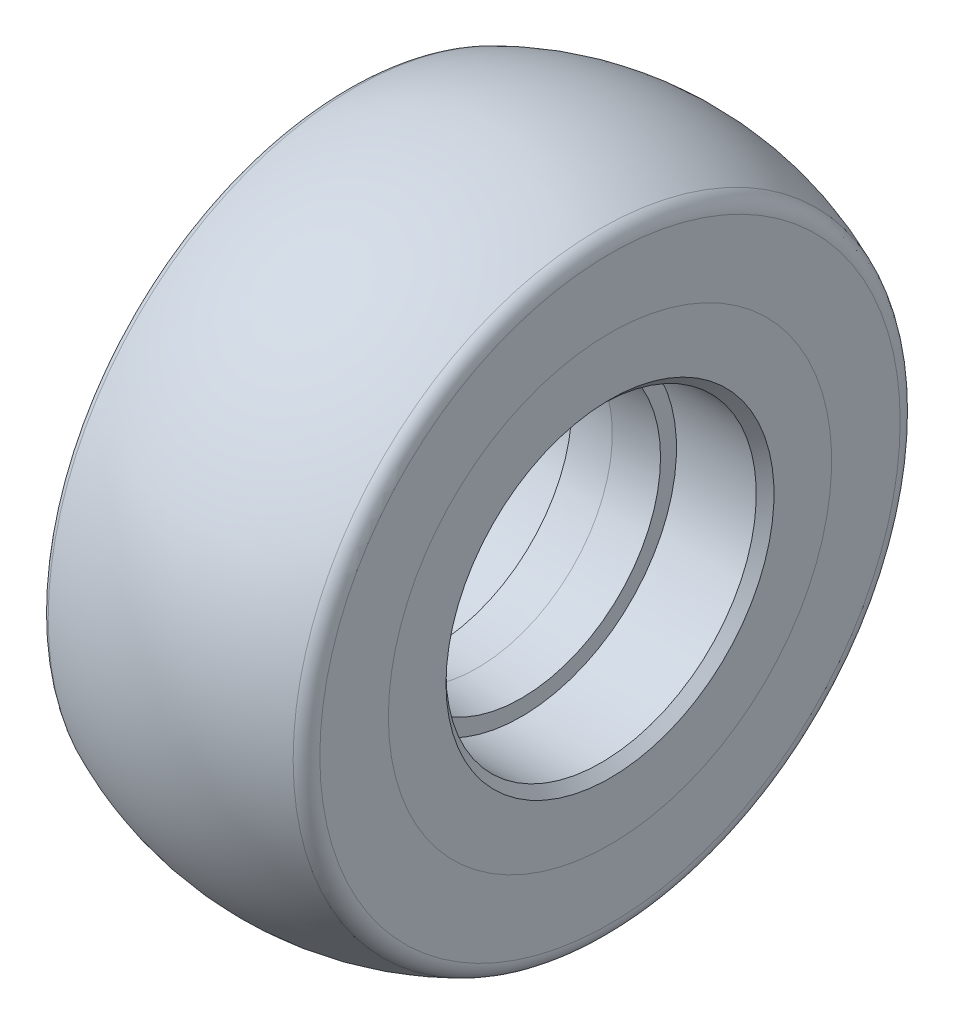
from build123d import *


with BuildPart() as part:
    # Sketch 1 → Revolve 1 (revolve)
    with BuildSketch(Plane(origin=(0, 0, 0), x_dir=(1, 0, 0), z_dir=(0, 1, 0)), mode=Mode.PRIVATE) as revolve_1_sk:
        with BuildLine():
            Line((15, 18.5), (15, 25))
            Line((15, 25), (10.549337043, 25.445066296))
            ThreePointArc((10.549337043, 25.445066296), (10.014001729, 25.548390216), (9.506207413, 25.746896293))
            Line((9.506207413, 25.746896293), (7.534812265, 26.732593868))
            ThreePointArc((7.534812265, 26.732593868), (6.986221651, 26.942592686), (6.407226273, 27.041665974))
            Line((6.407226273, 27.041665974), (0, 27.5))
            Line((0, 27.5), (-6.407226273, 27.041665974))
            ThreePointArc((-6.407226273, 27.041665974), (-6.986221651, 26.942592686), (-7.534812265, 26.732593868))
            Line((-7.534812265, 26.732593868), (-9.506207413, 25.746896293))
            ThreePointArc((-9.506207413, 25.746896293), (-10.014001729, 25.548390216), (-10.549337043, 25.445066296))
            Line((-10.549337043, 25.445066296), (-15, 25))
            Line((-15, 25), (-15, 18.5))
            Line((-15, 18.5), (-14, 17.5))
            Line((-14, 17.5), (-5, 17.5))
            Line((-5, 17.5), (-5, 15.7))
            Line((-5, 15.7), (0, 15.262556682))
            Line((0, 15.262556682), (5, 15.7))
            Line((5, 15.7), (5, 17.5))
            Line((5, 17.5), (14, 17.5))
            Line((14, 17.5), (15, 18.5))
        make_face()
    revolve(revolve_1_sk.sketch.rotate(Axis((-18.939064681, 0, 0), (1, 0, 0)), 180), axis=Axis((-18.939064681, 0, 0), (1, 0, 0)))


with BuildPart() as body_2:
    # Sketch 2 → Revolve 2 (revolve)
    with BuildSketch(Plane(origin=(0, 0, 0), x_dir=(1, 0, 0), z_dir=(0, 1, 0)), mode=Mode.PRIVATE) as revolve_2_sk:
        with BuildLine():
            Line((-15, 25), (-10.549337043, 25.445066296))
            ThreePointArc((-10.549337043, 25.445066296), (-10.014001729, 25.548390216), (-9.506207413, 25.746896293))
            Line((-9.506207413, 25.746896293), (-7.534812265, 26.732593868))
            ThreePointArc((-7.534812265, 26.732593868), (-6.986221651, 26.942592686), (-6.407226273, 27.041665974))
            Line((-6.407226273, 27.041665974), (0, 27.5))
            Line((0, 27.5), (6.407226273, 27.041665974))
            ThreePointArc((6.407226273, 27.041665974), (6.986221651, 26.942592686), (7.534812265, 26.732593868))
            Line((7.534812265, 26.732593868), (9.506207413, 25.746896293))
            ThreePointArc((9.506207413, 25.746896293), (10.014001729, 25.548390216), (10.549337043, 25.445066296))
            Line((10.549337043, 25.445066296), (15, 25))
            Line((15, 25), (15, 32.730911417))
            ThreePointArc((15, 32.730911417), (14.677810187, 33.819466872), (13.815047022, 34.557300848))
            ThreePointArc((13.815047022, 34.557300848), (0, 37.5), (-13.815047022, 34.557300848))
            ThreePointArc((-13.815047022, 34.557300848), (-14.677810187, 33.819466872), (-15, 32.730911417))
            Line((-15, 32.730911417), (-15, 25))
        make_face()
    revolve(revolve_2_sk.sketch.rotate(Axis((-18.939064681, 0, 0), (1, 0, 0)), 180), axis=Axis((-18.939064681, 0, 0), (1, 0, 0)))


solid = Compound([part.part, body_2.part])
